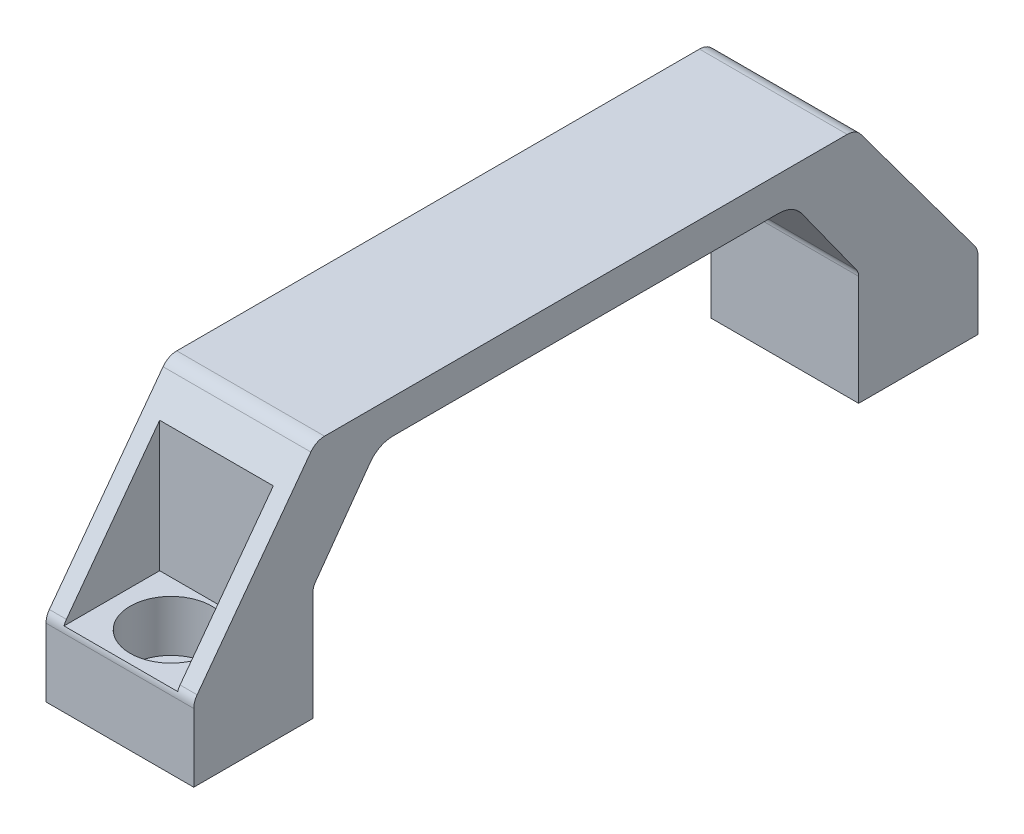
ISO-10303-21;
HEADER;
FILE_DESCRIPTION(('STEP AP214'),'2;1');
FILE_NAME('part.step','',(''),(''),'','','');
FILE_SCHEMA(('AUTOMOTIVE_DESIGN { 1 0 10303 214 1 1 1 1 }'));
ENDSEC;
DATA;
#1=APPLICATION_CONTEXT('core data for automotive mechanical design processes');
#2=APPLICATION_PROTOCOL_DEFINITION('international standard','automotive_design',2000,#1);
#3=PRODUCT_CONTEXT('',#1,'mechanical');
#4=PRODUCT('Part','Part','',(#3));
#5=PRODUCT_RELATED_PRODUCT_CATEGORY('part','',(#4));
#6=PRODUCT_DEFINITION_FORMATION('','',#4);
#7=PRODUCT_DEFINITION_CONTEXT('part definition',#1,'design');
#8=PRODUCT_DEFINITION('design','',#6,#7);
#9=PRODUCT_DEFINITION_SHAPE('','',#8);
#10=(LENGTH_UNIT() NAMED_UNIT(*) SI_UNIT(.MILLI.,.METRE.));
#11=(NAMED_UNIT(*) PLANE_ANGLE_UNIT() SI_UNIT($,.RADIAN.));
#12=(NAMED_UNIT(*) SI_UNIT($,.STERADIAN.) SOLID_ANGLE_UNIT());
#13=UNCERTAINTY_MEASURE_WITH_UNIT(LENGTH_MEASURE(1.E-05),#10,'distance_accuracy_value','');
#14=(GEOMETRIC_REPRESENTATION_CONTEXT(3) GLOBAL_UNCERTAINTY_ASSIGNED_CONTEXT((#13)) GLOBAL_UNIT_ASSIGNED_CONTEXT((#10,
#11,#12)) REPRESENTATION_CONTEXT('',''));
#15=CARTESIAN_POINT('',(0.,0.,0.));
#16=DIRECTION('',(0.,0.,1.));
#17=DIRECTION('',(1.,0.,0.));
#18=AXIS2_PLACEMENT_3D('',#15,#16,#17);
#19=CARTESIAN_POINT('',(0.,4.00000000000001,-55.6));
#20=DIRECTION('',(0.,1.,0.));
#21=DIRECTION('',(0.,0.,1.));
#22=AXIS2_PLACEMENT_3D('',#19,#20,#21);
#23=PLANE('',#22);
#24=CARTESIAN_POINT('',(0.,4.00000000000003,-60.));
#25=DIRECTION('',(0.,-1.,0.));
#26=DIRECTION('',(0.,0.,-1.));
#27=AXIS2_PLACEMENT_3D('',#24,#25,#26);
#28=CIRCLE('',#27,7.19999999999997);
#29=CARTESIAN_POINT('',(0.,4.00000000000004,-67.2));
#30=VERTEX_POINT('',#29);
#31=EDGE_CURVE('E19',#30,#30,#28,.F.);
#32=ORIENTED_EDGE('',*,*,#31,.T.);
#33=EDGE_LOOP('',(#32));
#34=FACE_BOUND('',#33,.T.);
#35=CARTESIAN_POINT('',(0.,4.,-60.));
#36=DIRECTION('',(0.,-1.,0.));
#37=DIRECTION('',(0.,0.,-1.));
#38=AXIS2_PLACEMENT_3D('',#35,#36,#37);
#39=CIRCLE('',#38,4.39999999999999);
#40=CARTESIAN_POINT('',(0.,4.00000000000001,-64.4));
#41=VERTEX_POINT('',#40);
#42=EDGE_CURVE('E590',#41,#41,#39,.T.);
#43=ORIENTED_EDGE('',*,*,#42,.T.);
#44=EDGE_LOOP('',(#43));
#45=FACE_BOUND('',#44,.T.);
#46=ADVANCED_FACE('F16',(#34,#45),#23,.T.);
#47=CARTESIAN_POINT('',(0.,13.,-60.));
#48=DIRECTION('',(0.,-1.,0.));
#49=DIRECTION('',(0.,0.,-1.));
#50=AXIS2_PLACEMENT_3D('',#47,#48,#49);
#51=CYLINDRICAL_SURFACE('',#50,7.19999999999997);
#52=ORIENTED_EDGE('',*,*,#31,.F.);
#53=EDGE_LOOP('',(#52));
#54=FACE_BOUND('',#53,.T.);
#55=CARTESIAN_POINT('',(0.,13.,-60.));
#56=DIRECTION('',(0.,-1.,0.));
#57=DIRECTION('',(0.,0.,-1.));
#58=AXIS2_PLACEMENT_3D('',#55,#56,#57);
#59=CIRCLE('',#58,7.19999999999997);
#60=CARTESIAN_POINT('',(0.,13.,-67.2));
#61=VERTEX_POINT('',#60);
#62=EDGE_CURVE('E358',#61,#61,#59,.T.);
#63=ORIENTED_EDGE('',*,*,#62,.F.);
#64=EDGE_LOOP('',(#63));
#65=FACE_BOUND('',#64,.T.);
#66=ADVANCED_FACE('F603',(#54,#65),#51,.F.);
#67=CARTESIAN_POINT('',(0.,0.,60.));
#68=DIRECTION('',(0.,1.,0.));
#69=DIRECTION('',(0.,0.,1.));
#70=AXIS2_PLACEMENT_3D('',#67,#68,#69);
#71=CYLINDRICAL_SURFACE('',#70,7.19999999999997);
#72=CARTESIAN_POINT('',(0.,4.00000000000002,60.));
#73=DIRECTION('',(0.,1.,0.));
#74=DIRECTION('',(0.,0.,1.));
#75=AXIS2_PLACEMENT_3D('',#72,#73,#74);
#76=CIRCLE('',#75,7.19999999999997);
#77=CARTESIAN_POINT('',(0.,4.00000000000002,67.2));
#78=VERTEX_POINT('',#77);
#79=EDGE_CURVE('E176',#78,#78,#76,.T.);
#80=ORIENTED_EDGE('',*,*,#79,.F.);
#81=EDGE_LOOP('',(#80));
#82=FACE_BOUND('',#81,.T.);
#83=CARTESIAN_POINT('',(0.,13.,60.));
#84=DIRECTION('',(0.,1.,0.));
#85=DIRECTION('',(0.,0.,1.));
#86=AXIS2_PLACEMENT_3D('',#83,#84,#85);
#87=CIRCLE('',#86,7.19999999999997);
#88=CARTESIAN_POINT('',(0.,13.,67.2));
#89=VERTEX_POINT('',#88);
#90=EDGE_CURVE('E338',#89,#89,#87,.F.);
#91=ORIENTED_EDGE('',*,*,#90,.F.);
#92=EDGE_LOOP('',(#91));
#93=FACE_BOUND('',#92,.T.);
#94=ADVANCED_FACE('F606',(#82,#93),#71,.F.);
#95=CARTESIAN_POINT('',(0.,4.,52.8));
#96=DIRECTION('',(0.,1.,0.));
#97=DIRECTION('',(0.,0.,1.));
#98=AXIS2_PLACEMENT_3D('',#95,#96,#97);
#99=PLANE('',#98);
#100=CARTESIAN_POINT('',(0.,4.,60.));
#101=DIRECTION('',(0.,1.,0.));
#102=DIRECTION('',(0.,0.,1.));
#103=AXIS2_PLACEMENT_3D('',#100,#101,#102);
#104=CIRCLE('',#103,4.39999999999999);
#105=CARTESIAN_POINT('',(0.,4.00000000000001,64.4));
#106=VERTEX_POINT('',#105);
#107=EDGE_CURVE('E613',#106,#106,#104,.F.);
#108=ORIENTED_EDGE('',*,*,#107,.T.);
#109=EDGE_LOOP('',(#108));
#110=FACE_BOUND('',#109,.T.);
#111=ORIENTED_EDGE('',*,*,#79,.T.);
#112=EDGE_LOOP('',(#111));
#113=FACE_BOUND('',#112,.T.);
#114=ADVANCED_FACE('F680',(#110,#113),#99,.T.);
#115=CARTESIAN_POINT('',(13.,19.3558155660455,-45.9999999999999));
#116=DIRECTION('',(1.,0.,0.));
#117=DIRECTION('',(0.,0.,-1.));
#118=AXIS2_PLACEMENT_3D('',#115,#116,#117);
#119=CYLINDRICAL_SURFACE('',#118,2.00000000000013);
#120=CARTESIAN_POINT('',(13.,19.3558155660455,-45.9999999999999));
#121=DIRECTION('',(1.,0.,0.));
#122=DIRECTION('',(0.,0.,-1.));
#123=AXIS2_PLACEMENT_3D('',#120,#121,#122);
#124=CIRCLE('',#123,2.00000000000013);
#125=CARTESIAN_POINT('',(13.,20.5230876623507,-47.6240307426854));
#126=VERTEX_POINT('',#125);
#127=CARTESIAN_POINT('',(13.,19.3558155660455,-48.));
#128=VERTEX_POINT('',#127);
#129=EDGE_CURVE('E175',#126,#128,#124,.F.);
#130=ORIENTED_EDGE('',*,*,#129,.F.);
#131=DIRECTION('',(1.,0.,0.));
#132=VECTOR('',#131,1.);
#133=CARTESIAN_POINT('',(13.,20.5230876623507,-47.6240307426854));
#134=LINE('',#133,#132);
#135=CARTESIAN_POINT('',(-13.,20.5230876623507,-47.6240307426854));
#136=VERTEX_POINT('',#135);
#137=EDGE_CURVE('E179',#126,#136,#134,.F.);
#138=ORIENTED_EDGE('',*,*,#137,.T.);
#139=CARTESIAN_POINT('',(-13.,19.3558155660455,-45.9999999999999));
#140=DIRECTION('',(1.,0.,0.));
#141=DIRECTION('',(0.,0.,-1.));
#142=AXIS2_PLACEMENT_3D('',#139,#140,#141);
#143=CIRCLE('',#142,2.00000000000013);
#144=CARTESIAN_POINT('',(-13.,19.3558155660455,-48.));
#145=VERTEX_POINT('',#144);
#146=EDGE_CURVE('E159',#145,#136,#143,.T.);
#147=ORIENTED_EDGE('',*,*,#146,.F.);
#148=DIRECTION('',(-1.,0.,0.));
#149=VECTOR('',#148,1.);
#150=CARTESIAN_POINT('',(13.,19.3558155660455,-48.));
#151=LINE('',#150,#149);
#152=EDGE_CURVE('E184',#145,#128,#151,.F.);
#153=ORIENTED_EDGE('',*,*,#152,.T.);
#154=EDGE_LOOP('',(#130,#138,#147,#153));
#155=FACE_BOUND('',#154,.T.);
#156=ADVANCED_FACE('F180',(#155),#119,.F.);
#157=CARTESIAN_POINT('',(0.,13.,-60.));
#158=DIRECTION('',(0.,-1.,0.));
#159=DIRECTION('',(0.,0.,-1.));
#160=AXIS2_PLACEMENT_3D('',#157,#158,#159);
#161=CYLINDRICAL_SURFACE('',#160,4.39999999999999);
#162=ORIENTED_EDGE('',*,*,#42,.F.);
#163=EDGE_LOOP('',(#162));
#164=FACE_BOUND('',#163,.T.);
#165=CARTESIAN_POINT('',(0.,0.,-60.));
#166=DIRECTION('',(0.,-1.,0.));
#167=DIRECTION('',(0.,0.,-1.));
#168=AXIS2_PLACEMENT_3D('',#165,#166,#167);
#169=CIRCLE('',#168,4.39999999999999);
#170=CARTESIAN_POINT('',(0.,0.,-64.4));
#171=VERTEX_POINT('',#170);
#172=EDGE_CURVE('E250',#171,#171,#169,.T.);
#173=ORIENTED_EDGE('',*,*,#172,.T.);
#174=EDGE_LOOP('',(#173));
#175=FACE_BOUND('',#174,.T.);
#176=ADVANCED_FACE('F674',(#164,#175),#161,.F.);
#177=CARTESIAN_POINT('',(0.,13.,0.));
#178=DIRECTION('',(0.,1.,0.));
#179=DIRECTION('',(0.,0.,1.));
#180=AXIS2_PLACEMENT_3D('',#177,#178,#179);
#181=PLANE('',#180);
#182=ORIENTED_EDGE('',*,*,#62,.T.);
#183=EDGE_LOOP('',(#182));
#184=FACE_BOUND('',#183,.T.);
#185=DIRECTION('',(1.,0.,0.));
#186=VECTOR('',#185,1.);
#187=CARTESIAN_POINT('',(13.,13.,-68.8316717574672));
#188=LINE('',#187,#186);
#189=CARTESIAN_POINT('',(-10.,13.,-68.8316717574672));
#190=VERTEX_POINT('',#189);
#191=CARTESIAN_POINT('',(10.,13.,-68.8316717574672));
#192=VERTEX_POINT('',#191);
#193=EDGE_CURVE('E361',#190,#192,#188,.T.);
#194=ORIENTED_EDGE('',*,*,#193,.F.);
#195=DIRECTION('',(0.,0.,-1.));
#196=VECTOR('',#195,1.);
#197=CARTESIAN_POINT('',(-10.,13.,-142.));
#198=LINE('',#197,#196);
#199=CARTESIAN_POINT('',(-10.,13.,-52.));
#200=VERTEX_POINT('',#199);
#201=EDGE_CURVE('E356',#200,#190,#198,.T.);
#202=ORIENTED_EDGE('',*,*,#201,.F.);
#203=DIRECTION('',(-1.,0.,0.));
#204=VECTOR('',#203,1.);
#205=CARTESIAN_POINT('',(-10.,13.,-52.));
#206=LINE('',#205,#204);
#207=CARTESIAN_POINT('',(10.,13.,-52.));
#208=VERTEX_POINT('',#207);
#209=EDGE_CURVE('E353',#208,#200,#206,.T.);
#210=ORIENTED_EDGE('',*,*,#209,.F.);
#211=DIRECTION('',(0.,0.,1.));
#212=VECTOR('',#211,1.);
#213=CARTESIAN_POINT('',(10.,13.,-52.));
#214=LINE('',#213,#212);
#215=EDGE_CURVE('E335',#192,#208,#214,.T.);
#216=ORIENTED_EDGE('',*,*,#215,.F.);
#217=EDGE_LOOP('',(#194,#202,#210,#216));
#218=FACE_BOUND('',#217,.T.);
#219=ADVANCED_FACE('F670',(#184,#218),#181,.T.);
#220=CARTESIAN_POINT('',(-10.,55.,-142.));
#221=DIRECTION('',(1.,0.,0.));
#222=DIRECTION('',(0.,0.,-1.));
#223=AXIS2_PLACEMENT_3D('',#220,#221,#222);
#224=PLANE('',#223);
#225=CARTESIAN_POINT('',(-10.,12.0092250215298,-66.));
#226=DIRECTION('',(1.,0.,0.));
#227=DIRECTION('',(0.,0.,-1.));
#228=AXIS2_PLACEMENT_3D('',#225,#226,#227);
#229=CIRCLE('',#228,3.00000000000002);
#230=CARTESIAN_POINT('',(-10.,13.7959012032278,-68.4099353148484));
#231=VERTEX_POINT('',#230);
#232=EDGE_CURVE('E249',#231,#190,#229,.F.);
#233=ORIENTED_EDGE('',*,*,#232,.F.);
#234=DIRECTION('',(0.,-0.803311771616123,-0.595558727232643));
#235=VECTOR('',#234,1.);
#236=CARTESIAN_POINT('',(-10.,13.7959012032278,-68.4099353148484));
#237=LINE('',#236,#235);
#238=CARTESIAN_POINT('',(-10.,35.9302325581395,-52.));
#239=VERTEX_POINT('',#238);
#240=EDGE_CURVE('E244',#231,#239,#237,.F.);
#241=ORIENTED_EDGE('',*,*,#240,.T.);
#242=DIRECTION('',(0.,1.,0.));
#243=VECTOR('',#242,1.);
#244=CARTESIAN_POINT('',(-10.,55.,-52.));
#245=LINE('',#244,#243);
#246=EDGE_CURVE('E344',#200,#239,#245,.T.);
#247=ORIENTED_EDGE('',*,*,#246,.F.);
#248=ORIENTED_EDGE('',*,*,#201,.T.);
#249=EDGE_LOOP('',(#233,#241,#247,#248));
#250=FACE_BOUND('',#249,.T.);
#251=ADVANCED_FACE('F666',(#250),#224,.T.);
#252=CARTESIAN_POINT('',(-10.,55.,-52.));
#253=DIRECTION('',(0.,0.,-1.));
#254=DIRECTION('',(-1.,0.,0.));
#255=AXIS2_PLACEMENT_3D('',#252,#253,#254);
#256=PLANE('',#255);
#257=DIRECTION('',(1.,0.,0.));
#258=VECTOR('',#257,1.);
#259=CARTESIAN_POINT('',(13.,35.9302325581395,-52.));
#260=LINE('',#259,#258);
#261=CARTESIAN_POINT('',(10.,35.9302325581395,-52.));
#262=VERTEX_POINT('',#261);
#263=EDGE_CURVE('E328',#239,#262,#260,.T.);
#264=ORIENTED_EDGE('',*,*,#263,.T.);
#265=DIRECTION('',(0.,1.,0.));
#266=VECTOR('',#265,1.);
#267=CARTESIAN_POINT('',(10.,55.,-52.));
#268=LINE('',#267,#266);
#269=EDGE_CURVE('E339',#208,#262,#268,.T.);
#270=ORIENTED_EDGE('',*,*,#269,.F.);
#271=ORIENTED_EDGE('',*,*,#209,.T.);
#272=ORIENTED_EDGE('',*,*,#246,.T.);
#273=EDGE_LOOP('',(#264,#270,#271,#272));
#274=FACE_BOUND('',#273,.T.);
#275=ADVANCED_FACE('F659',(#274),#256,.T.);
#276=CARTESIAN_POINT('',(10.,55.,-52.));
#277=DIRECTION('',(-1.,0.,0.));
#278=DIRECTION('',(0.,0.,1.));
#279=AXIS2_PLACEMENT_3D('',#276,#277,#278);
#280=PLANE('',#279);
#281=CARTESIAN_POINT('',(10.,12.0092250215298,-66.));
#282=DIRECTION('',(1.,0.,0.));
#283=DIRECTION('',(0.,0.,-1.));
#284=AXIS2_PLACEMENT_3D('',#281,#282,#283);
#285=CIRCLE('',#284,3.00000000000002);
#286=CARTESIAN_POINT('',(10.,13.7959012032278,-68.4099353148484));
#287=VERTEX_POINT('',#286);
#288=EDGE_CURVE('E245',#192,#287,#285,.T.);
#289=ORIENTED_EDGE('',*,*,#288,.F.);
#290=ORIENTED_EDGE('',*,*,#215,.T.);
#291=ORIENTED_EDGE('',*,*,#269,.T.);
#292=DIRECTION('',(0.,-0.803311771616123,-0.595558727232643));
#293=VECTOR('',#292,1.);
#294=CARTESIAN_POINT('',(10.,13.7959012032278,-68.4099353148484));
#295=LINE('',#294,#293);
#296=EDGE_CURVE('E241',#262,#287,#295,.T.);
#297=ORIENTED_EDGE('',*,*,#296,.T.);
#298=EDGE_LOOP('',(#289,#290,#291,#297));
#299=FACE_BOUND('',#298,.T.);
#300=ADVANCED_FACE('F650',(#299),#280,.T.);
#301=CARTESIAN_POINT('',(0.,13.,0.));
#302=DIRECTION('',(0.,1.,0.));
#303=DIRECTION('',(0.,0.,1.));
#304=AXIS2_PLACEMENT_3D('',#301,#302,#303);
#305=PLANE('',#304);
#306=ORIENTED_EDGE('',*,*,#90,.T.);
#307=EDGE_LOOP('',(#306));
#308=FACE_BOUND('',#307,.T.);
#309=DIRECTION('',(1.,0.,0.));
#310=VECTOR('',#309,1.);
#311=CARTESIAN_POINT('',(13.,13.,68.8316717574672));
#312=LINE('',#311,#310);
#313=CARTESIAN_POINT('',(10.,13.,68.8316717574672));
#314=VERTEX_POINT('',#313);
#315=CARTESIAN_POINT('',(-10.,13.,68.8316717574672));
#316=VERTEX_POINT('',#315);
#317=EDGE_CURVE('E324',#314,#316,#312,.F.);
#318=ORIENTED_EDGE('',*,*,#317,.F.);
#319=DIRECTION('',(0.,0.,1.));
#320=VECTOR('',#319,1.);
#321=CARTESIAN_POINT('',(10.,13.,142.));
#322=LINE('',#321,#320);
#323=CARTESIAN_POINT('',(10.,13.,52.));
#324=VERTEX_POINT('',#323);
#325=EDGE_CURVE('E292',#324,#314,#322,.T.);
#326=ORIENTED_EDGE('',*,*,#325,.F.);
#327=DIRECTION('',(1.,0.,0.));
#328=VECTOR('',#327,1.);
#329=CARTESIAN_POINT('',(10.,13.,52.));
#330=LINE('',#329,#328);
#331=CARTESIAN_POINT('',(-10.,13.,52.));
#332=VERTEX_POINT('',#331);
#333=EDGE_CURVE('E294',#332,#324,#330,.T.);
#334=ORIENTED_EDGE('',*,*,#333,.F.);
#335=DIRECTION('',(0.,0.,-1.));
#336=VECTOR('',#335,1.);
#337=CARTESIAN_POINT('',(-10.,13.,52.));
#338=LINE('',#337,#336);
#339=EDGE_CURVE('E295',#316,#332,#338,.T.);
#340=ORIENTED_EDGE('',*,*,#339,.F.);
#341=EDGE_LOOP('',(#318,#326,#334,#340));
#342=FACE_BOUND('',#341,.T.);
#343=ADVANCED_FACE('F647',(#308,#342),#305,.T.);
#344=CARTESIAN_POINT('',(0.,0.,60.));
#345=DIRECTION('',(0.,1.,0.));
#346=DIRECTION('',(0.,0.,1.));
#347=AXIS2_PLACEMENT_3D('',#344,#345,#346);
#348=CYLINDRICAL_SURFACE('',#347,4.39999999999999);
#349=ORIENTED_EDGE('',*,*,#107,.F.);
#350=EDGE_LOOP('',(#349));
#351=FACE_BOUND('',#350,.T.);
#352=CARTESIAN_POINT('',(0.,0.,60.));
#353=DIRECTION('',(0.,1.,0.));
#354=DIRECTION('',(0.,0.,1.));
#355=AXIS2_PLACEMENT_3D('',#352,#353,#354);
#356=CIRCLE('',#355,4.39999999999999);
#357=CARTESIAN_POINT('',(0.,0.,64.4));
#358=VERTEX_POINT('',#357);
#359=EDGE_CURVE('E209',#358,#358,#356,.F.);
#360=ORIENTED_EDGE('',*,*,#359,.T.);
#361=EDGE_LOOP('',(#360));
#362=FACE_BOUND('',#361,.T.);
#363=ADVANCED_FACE('F649',(#351,#362),#348,.F.);
#364=CARTESIAN_POINT('',(13.,19.3558155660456,46.));
#365=DIRECTION('',(1.,0.,0.));
#366=DIRECTION('',(0.,0.,-1.));
#367=AXIS2_PLACEMENT_3D('',#364,#365,#366);
#368=CYLINDRICAL_SURFACE('',#367,2.);
#369=CARTESIAN_POINT('',(13.,19.3558155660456,46.));
#370=DIRECTION('',(1.,0.,0.));
#371=DIRECTION('',(0.,0.,-1.));
#372=AXIS2_PLACEMENT_3D('',#369,#370,#371);
#373=CIRCLE('',#372,2.);
#374=CARTESIAN_POINT('',(13.,19.3558155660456,48.));
#375=VERTEX_POINT('',#374);
#376=CARTESIAN_POINT('',(13.,20.5230876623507,47.6240307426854));
#377=VERTEX_POINT('',#376);
#378=EDGE_CURVE('E317',#375,#377,#373,.F.);
#379=ORIENTED_EDGE('',*,*,#378,.F.);
#380=DIRECTION('',(1.,0.,0.));
#381=VECTOR('',#380,1.);
#382=CARTESIAN_POINT('',(13.,19.3558155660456,48.));
#383=LINE('',#382,#381);
#384=CARTESIAN_POINT('',(-13.,19.3558155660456,48.));
#385=VERTEX_POINT('',#384);
#386=EDGE_CURVE('E202',#375,#385,#383,.F.);
#387=ORIENTED_EDGE('',*,*,#386,.T.);
#388=CARTESIAN_POINT('',(-13.,19.3558155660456,46.));
#389=DIRECTION('',(1.,0.,0.));
#390=DIRECTION('',(0.,0.,-1.));
#391=AXIS2_PLACEMENT_3D('',#388,#389,#390);
#392=CIRCLE('',#391,2.);
#393=CARTESIAN_POINT('',(-13.,20.5230876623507,47.6240307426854));
#394=VERTEX_POINT('',#393);
#395=EDGE_CURVE('E616',#394,#385,#392,.T.);
#396=ORIENTED_EDGE('',*,*,#395,.F.);
#397=DIRECTION('',(1.,0.,0.));
#398=VECTOR('',#397,1.);
#399=CARTESIAN_POINT('',(13.,20.5230876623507,47.6240307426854));
#400=LINE('',#399,#398);
#401=EDGE_CURVE('E272',#394,#377,#400,.T.);
#402=ORIENTED_EDGE('',*,*,#401,.T.);
#403=EDGE_LOOP('',(#379,#387,#396,#402));
#404=FACE_BOUND('',#403,.T.);
#405=ADVANCED_FACE('F622',(#404),#368,.F.);
#406=CARTESIAN_POINT('',(-10.,55.,52.));
#407=DIRECTION('',(1.,0.,0.));
#408=DIRECTION('',(0.,0.,-1.));
#409=AXIS2_PLACEMENT_3D('',#406,#407,#408);
#410=PLANE('',#409);
#411=CARTESIAN_POINT('',(-10.,12.0092250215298,65.9999999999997));
#412=DIRECTION('',(1.,0.,0.));
#413=DIRECTION('',(0.,0.,-1.));
#414=AXIS2_PLACEMENT_3D('',#411,#412,#413);
#415=CIRCLE('',#414,3.00000000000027);
#416=CARTESIAN_POINT('',(-10.,13.7959012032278,68.4099353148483));
#417=VERTEX_POINT('',#416);
#418=EDGE_CURVE('E227',#316,#417,#415,.F.);
#419=ORIENTED_EDGE('',*,*,#418,.F.);
#420=ORIENTED_EDGE('',*,*,#339,.T.);
#421=DIRECTION('',(0.,1.,0.));
#422=VECTOR('',#421,1.);
#423=CARTESIAN_POINT('',(-10.,55.,52.));
#424=LINE('',#423,#422);
#425=CARTESIAN_POINT('',(-10.,35.9302325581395,52.));
#426=VERTEX_POINT('',#425);
#427=EDGE_CURVE('E275',#426,#332,#424,.F.);
#428=ORIENTED_EDGE('',*,*,#427,.F.);
#429=DIRECTION('',(0.,0.803311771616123,-0.595558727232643));
#430=VECTOR('',#429,1.);
#431=CARTESIAN_POINT('',(-10.,40.7866761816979,48.3995331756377));
#432=LINE('',#431,#430);
#433=EDGE_CURVE('E205',#426,#417,#432,.F.);
#434=ORIENTED_EDGE('',*,*,#433,.T.);
#435=EDGE_LOOP('',(#419,#420,#428,#434));
#436=FACE_BOUND('',#435,.T.);
#437=ADVANCED_FACE('F636',(#436),#410,.T.);
#438=CARTESIAN_POINT('',(10.,55.,142.));
#439=DIRECTION('',(-1.,0.,0.));
#440=DIRECTION('',(0.,0.,1.));
#441=AXIS2_PLACEMENT_3D('',#438,#439,#440);
#442=PLANE('',#441);
#443=CARTESIAN_POINT('',(10.,12.0092250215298,65.9999999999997));
#444=DIRECTION('',(1.,0.,0.));
#445=DIRECTION('',(0.,0.,-1.));
#446=AXIS2_PLACEMENT_3D('',#443,#444,#445);
#447=CIRCLE('',#446,3.00000000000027);
#448=CARTESIAN_POINT('',(10.,13.7959012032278,68.4099353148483));
#449=VERTEX_POINT('',#448);
#450=EDGE_CURVE('E286',#449,#314,#447,.T.);
#451=ORIENTED_EDGE('',*,*,#450,.F.);
#452=DIRECTION('',(0.,0.803311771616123,-0.595558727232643));
#453=VECTOR('',#452,1.);
#454=CARTESIAN_POINT('',(10.,40.7866761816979,48.3995331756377));
#455=LINE('',#454,#453);
#456=CARTESIAN_POINT('',(10.,35.9302325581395,52.));
#457=VERTEX_POINT('',#456);
#458=EDGE_CURVE('E231',#449,#457,#455,.T.);
#459=ORIENTED_EDGE('',*,*,#458,.T.);
#460=DIRECTION('',(0.,1.,0.));
#461=VECTOR('',#460,1.);
#462=CARTESIAN_POINT('',(10.,55.,52.));
#463=LINE('',#462,#461);
#464=EDGE_CURVE('E306',#324,#457,#463,.T.);
#465=ORIENTED_EDGE('',*,*,#464,.F.);
#466=ORIENTED_EDGE('',*,*,#325,.T.);
#467=EDGE_LOOP('',(#451,#459,#465,#466));
#468=FACE_BOUND('',#467,.T.);
#469=ADVANCED_FACE('F643',(#468),#442,.T.);
#470=CARTESIAN_POINT('',(10.,55.,52.));
#471=DIRECTION('',(0.,0.,1.));
#472=DIRECTION('',(1.,0.,0.));
#473=AXIS2_PLACEMENT_3D('',#470,#471,#472);
#474=PLANE('',#473);
#475=DIRECTION('',(1.,0.,0.));
#476=VECTOR('',#475,1.);
#477=CARTESIAN_POINT('',(13.,35.9302325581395,52.));
#478=LINE('',#477,#476);
#479=EDGE_CURVE('E193',#457,#426,#478,.F.);
#480=ORIENTED_EDGE('',*,*,#479,.T.);
#481=ORIENTED_EDGE('',*,*,#427,.T.);
#482=ORIENTED_EDGE('',*,*,#333,.T.);
#483=ORIENTED_EDGE('',*,*,#464,.T.);
#484=EDGE_LOOP('',(#480,#481,#482,#483));
#485=FACE_BOUND('',#484,.T.);
#486=ADVANCED_FACE('F640',(#485),#474,.T.);
#487=CARTESIAN_POINT('',(13.,20.5230876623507,47.6240307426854));
#488=DIRECTION('',(0.,0.583636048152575,0.812015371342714));
#489=DIRECTION('',(0.,-0.812015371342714,0.583636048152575));
#490=AXIS2_PLACEMENT_3D('',#487,#488,#489);
#491=PLANE('',#490);
#492=DIRECTION('',(0.,0.812015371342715,-0.583636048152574));
#493=VECTOR('',#492,1.);
#494=CARTESIAN_POINT('',(13.,20.5230876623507,47.6240307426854));
#495=LINE('',#494,#493);
#496=CARTESIAN_POINT('',(13.,33.9181802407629,37.9963079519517));
#497=VERTEX_POINT('',#496);
#498=EDGE_CURVE('E388',#377,#497,#495,.T.);
#499=ORIENTED_EDGE('',*,*,#498,.F.);
#500=ORIENTED_EDGE('',*,*,#401,.F.);
#501=DIRECTION('',(0.,0.812015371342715,-0.583636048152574));
#502=VECTOR('',#501,1.);
#503=CARTESIAN_POINT('',(-13.,20.5230876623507,47.6240307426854));
#504=LINE('',#503,#502);
#505=CARTESIAN_POINT('',(-13.,33.9181802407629,37.9963079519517));
#506=VERTEX_POINT('',#505);
#507=EDGE_CURVE('E393',#394,#506,#504,.T.);
#508=ORIENTED_EDGE('',*,*,#507,.T.);
#509=DIRECTION('',(1.,0.,0.));
#510=VECTOR('',#509,1.);
#511=CARTESIAN_POINT('',(13.,33.9181802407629,37.9963079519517));
#512=LINE('',#511,#510);
#513=EDGE_CURVE('E268',#506,#497,#512,.T.);
#514=ORIENTED_EDGE('',*,*,#513,.T.);
#515=EDGE_LOOP('',(#499,#500,#508,#514));
#516=FACE_BOUND('',#515,.T.);
#517=ADVANCED_FACE('F768',(#516),#491,.F.);
#518=CARTESIAN_POINT('',(13.,31.,33.9362310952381));
#519=DIRECTION('',(1.,0.,0.));
#520=DIRECTION('',(0.,0.,-1.));
#521=AXIS2_PLACEMENT_3D('',#518,#519,#520);
#522=CYLINDRICAL_SURFACE('',#521,4.99999999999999);
#523=CARTESIAN_POINT('',(13.,31.,33.9362310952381));
#524=DIRECTION('',(1.,0.,0.));
#525=DIRECTION('',(0.,0.,-1.));
#526=AXIS2_PLACEMENT_3D('',#523,#524,#525);
#527=CIRCLE('',#526,4.99999999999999);
#528=CARTESIAN_POINT('',(13.,36.,33.9362310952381));
#529=VERTEX_POINT('',#528);
#530=EDGE_CURVE('E386',#497,#529,#527,.F.);
#531=ORIENTED_EDGE('',*,*,#530,.F.);
#532=ORIENTED_EDGE('',*,*,#513,.F.);
#533=CARTESIAN_POINT('',(-13.,31.,33.9362310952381));
#534=DIRECTION('',(1.,0.,0.));
#535=DIRECTION('',(0.,0.,-1.));
#536=AXIS2_PLACEMENT_3D('',#533,#534,#535);
#537=CIRCLE('',#536,4.99999999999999);
#538=CARTESIAN_POINT('',(-13.,36.,33.9362310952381));
#539=VERTEX_POINT('',#538);
#540=EDGE_CURVE('E390',#506,#539,#537,.F.);
#541=ORIENTED_EDGE('',*,*,#540,.T.);
#542=CARTESIAN_POINT('',(13.,36.,33.9362310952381));
#543=CARTESIAN_POINT('',(13.0000157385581,36.0000056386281,33.9847392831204));
#544=CARTESIAN_POINT('',(12.997758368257,35.9992934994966,34.0332170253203));
#545=CARTESIAN_POINT('',(12.9888536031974,35.9964884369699,34.1296647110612));
#546=CARTESIAN_POINT('',(12.9822120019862,35.9943973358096,34.1776352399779));
#547=CARTESIAN_POINT('',(12.9561728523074,35.9862093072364,34.3190199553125));
#548=CARTESIAN_POINT('',(12.9306515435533,35.9781944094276,34.4112414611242));
#549=CARTESIAN_POINT('',(12.8586713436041,35.9557056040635,34.609272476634));
#550=CARTESIAN_POINT('',(12.8088831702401,35.9402112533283,34.7137209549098));
#551=CARTESIAN_POINT('',(12.6937031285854,35.9046734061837,34.913234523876));
#552=CARTESIAN_POINT('',(12.6282305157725,35.8846063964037,35.0082473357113));
#553=CARTESIAN_POINT('',(12.4995359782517,35.8455588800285,35.1716352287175));
#554=CARTESIAN_POINT('',(12.4382058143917,35.8270835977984,35.2416597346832));
#555=CARTESIAN_POINT('',(12.309848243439,35.7887573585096,35.3759076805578));
#556=CARTESIAN_POINT('',(12.2428169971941,35.768905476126,35.4401271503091));
#557=CARTESIAN_POINT('',(12.0350399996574,35.7079607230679,35.625032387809));
#558=CARTESIAN_POINT('',(11.8877042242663,35.6655072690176,35.7378538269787));
#559=CARTESIAN_POINT('',(11.5763372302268,35.577728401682,35.9507071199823));
#560=CARTESIAN_POINT('',(11.4118803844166,35.5323554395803,36.0500743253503));
#561=CARTESIAN_POINT('',(11.0749923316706,35.4416572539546,36.2345410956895));
#562=CARTESIAN_POINT('',(10.902552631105,35.3963321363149,36.3196249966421));
#563=CARTESIAN_POINT('',(10.5518710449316,35.3065455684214,36.4782731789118));
#564=CARTESIAN_POINT('',(10.3736182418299,35.2620860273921,36.5518140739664));
#565=CARTESIAN_POINT('',(10.0131826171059,35.1746737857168,36.6891752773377));
#566=CARTESIAN_POINT('',(9.83100160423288,35.1317204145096,36.7529999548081));
#567=CARTESIAN_POINT('',(9.3651601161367,35.0251262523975,36.9045661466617));
#568=CARTESIAN_POINT('',(9.07942636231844,34.9627318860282,36.9868000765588));
#569=CARTESIAN_POINT('',(8.50294866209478,34.8430529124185,37.1362399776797));
#570=CARTESIAN_POINT('',(8.21220245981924,34.7857706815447,37.203438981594));
#571=CARTESIAN_POINT('',(7.62666575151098,34.6767066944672,37.3257064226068));
#572=CARTESIAN_POINT('',(7.33186942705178,34.6249340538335,37.380754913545));
#573=CARTESIAN_POINT('',(6.73958359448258,34.5272820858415,37.4806846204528));
#574=CARTESIAN_POINT('',(6.44209383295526,34.4814033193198,37.5255648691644));
#575=CARTESIAN_POINT('',(5.84314954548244,34.3954526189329,37.6069835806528));
#576=CARTESIAN_POINT('',(5.54168181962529,34.3554202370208,37.6434661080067));
#577=CARTESIAN_POINT('',(4.93716715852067,34.2816440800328,37.7089277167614));
#578=CARTESIAN_POINT('',(4.63412018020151,34.2479004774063,37.7379065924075));
#579=CARTESIAN_POINT('',(4.02713296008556,34.1868179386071,37.7892534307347));
#580=CARTESIAN_POINT('',(3.7231939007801,34.1594726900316,37.8116279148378));
#581=CARTESIAN_POINT('',(3.1144299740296,34.1111999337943,37.8504854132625));
#582=CARTESIAN_POINT('',(2.80960508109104,34.0902726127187,37.8669682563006));
#583=CARTESIAN_POINT('',(2.03940457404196,34.0455986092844,37.9017745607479));
#584=CARTESIAN_POINT('',(1.57361112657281,34.0261223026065,37.9165354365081));
#585=CARTESIAN_POINT('',(0.641388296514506,34.0022420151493,37.9345747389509));
#586=CARTESIAN_POINT('',(0.174958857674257,33.9978394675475,37.9378520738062));
#587=CARTESIAN_POINT('',(-0.7584705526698,34.0041286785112,37.933133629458));
#588=CARTESIAN_POINT('',(-1.22547028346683,34.0148439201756,37.9251203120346));
#589=CARTESIAN_POINT('',(-2.15849703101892,34.0513735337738,37.8972479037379));
#590=CARTESIAN_POINT('',(-2.62452412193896,34.0771867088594,37.8773897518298));
#591=CARTESIAN_POINT('',(-3.5505646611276,34.1435093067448,37.8246919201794));
#592=CARTESIAN_POINT('',(-4.01059443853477,34.1838840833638,37.7919709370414));
#593=CARTESIAN_POINT('',(-4.92797340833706,34.2791935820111,37.7112597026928));
#594=CARTESIAN_POINT('',(-5.38532191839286,34.3341318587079,37.6632657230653));
#595=CARTESIAN_POINT('',(-6.06756426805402,34.4271120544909,37.5771983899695));
#596=CARTESIAN_POINT('',(-6.29409695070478,34.4598250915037,37.5462057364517));
#597=CARTESIAN_POINT('',(-6.7458369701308,34.52871296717,37.4789018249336));
#598=CARTESIAN_POINT('',(-6.97104439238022,34.5648875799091,37.4425909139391));
#599=CARTESIAN_POINT('',(-7.41971575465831,34.6405872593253,37.363927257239));
#600=CARTESIAN_POINT('',(-7.64318054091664,34.6801105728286,37.3215776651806));
#601=CARTESIAN_POINT('',(-8.08805812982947,34.7623904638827,37.2298948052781));
#602=CARTESIAN_POINT('',(-8.30947121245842,34.8051465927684,37.180562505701));
#603=CARTESIAN_POINT('',(-8.67086528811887,34.8778467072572,37.0928559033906));
#604=CARTESIAN_POINT('',(-8.8116114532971,34.9068952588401,37.0568845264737));
#605=CARTESIAN_POINT('',(-9.09184744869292,34.9661813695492,36.9811809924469));
#606=CARTESIAN_POINT('',(-9.23133723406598,34.9964189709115,36.9414487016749));
#607=CARTESIAN_POINT('',(-9.50917002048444,35.0580755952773,36.8576581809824));
#608=CARTESIAN_POINT('',(-9.64750906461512,35.089497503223,36.8135889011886));
#609=CARTESIAN_POINT('',(-9.92233806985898,35.1533302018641,36.7206567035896));
#610=CARTESIAN_POINT('',(-10.058828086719,35.18574096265,36.6717939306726));
#611=CARTESIAN_POINT('',(-10.3507299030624,35.2565383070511,36.5605204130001));
#612=CARTESIAN_POINT('',(-10.5057588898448,35.2950660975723,36.4971862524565));
#613=CARTESIAN_POINT('',(-10.8118089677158,35.3728916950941,36.3619088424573));
#614=CARTESIAN_POINT('',(-10.9628309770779,35.4121893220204,36.2899675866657));
#615=CARTESIAN_POINT('',(-11.25895471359,35.4909073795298,36.1360502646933));
#616=CARTESIAN_POINT('',(-11.4040760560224,35.530326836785,36.0541118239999));
#617=CARTESIAN_POINT('',(-11.6866849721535,35.6086105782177,35.8778851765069));
#618=CARTESIAN_POINT('',(-11.8241813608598,35.6474754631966,35.7836116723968));
#619=CARTESIAN_POINT('',(-12.0582925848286,35.7148171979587,35.6028351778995));
#620=CARTESIAN_POINT('',(-12.1571321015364,35.7436594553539,35.5193776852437));
#621=CARTESIAN_POINT('',(-12.3456717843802,35.7993480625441,35.3415636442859));
#622=CARTESIAN_POINT('',(-12.435353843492,35.8261904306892,35.2471862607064));
#623=CARTESIAN_POINT('',(-12.6024720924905,35.876724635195,35.04466470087));
#624=CARTESIAN_POINT('',(-12.6797073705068,35.9003639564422,34.9363374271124));
#625=CARTESIAN_POINT('',(-12.8133940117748,35.9415948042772,34.7069578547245));
#626=CARTESIAN_POINT('',(-12.8699816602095,35.9592259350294,34.5859960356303));
#627=CARTESIAN_POINT('',(-12.9405569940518,35.9813027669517,34.3763020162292));
#628=CARTESIAN_POINT('',(-12.9624818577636,35.9881918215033,34.2905321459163));
#629=CARTESIAN_POINT('',(-12.9847995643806,35.9952119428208,34.1594157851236));
#630=CARTESIAN_POINT('',(-12.9904787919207,35.9970002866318,34.115023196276));
#631=CARTESIAN_POINT('',(-12.998087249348,35.9993971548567,34.0258383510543));
#632=CARTESIAN_POINT('',(-13.000012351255,36.0000043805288,33.9810457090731));
#633=CARTESIAN_POINT('',(-13.,36.,33.9362310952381));
#634=B_SPLINE_CURVE_WITH_KNOTS('',3,(#542,#543,#544,#545,#546,#547,#548,#549,#550,#551,#552,
#553,#554,#555,#556,#557,#558,#559,#560,#561,#562,#563,#564,#565,#566,#567,#568,#569,#570,#571,
#572,#573,#574,#575,#576,#577,#578,#579,#580,#581,#582,#583,#584,#585,#586,#587,#588,#589,#590,
#591,#592,#593,#594,#595,#596,#597,#598,#599,#600,#601,#602,#603,#604,#605,#606,#607,#608,#609,
#610,#611,#612,#613,#614,#615,#616,#617,#618,#619,#620,#621,#622,#623,#624,#625,#626,#627,#628,
#629,#630,#631,#632,#633),.UNSPECIFIED.,.F.,.F.,(4,2,2,2,2,2,2,2,2,2,2,2,2,2,2,2,2,2,2,2,2,2,2,
2,2,2,2,2,2,2,2,2,2,2,2,2,2,2,2,2,2,2,2,2,2,4),(0.,0.145411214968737,0.29063065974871,
0.577131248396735,0.925443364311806,1.27558867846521,1.55989374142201,1.84439179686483,
2.41382669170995,3.00531776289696,3.59745332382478,4.19077348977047,4.78382606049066,
5.69462729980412,6.60584974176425,7.51855709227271,8.43135122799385,9.35005987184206,
10.2687937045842,11.1866172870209,12.1044675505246,13.5033472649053,14.9023599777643,
16.3035482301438,17.7046254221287,19.0930662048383,20.4818461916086,21.1746874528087,
21.8674835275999,22.5599191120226,23.2522587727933,23.696648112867,24.1410532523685,
24.5866215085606,25.0321763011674,25.5474814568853,26.0626674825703,26.5759711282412,
27.0886684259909,27.4856946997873,27.8834914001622,28.2871762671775,28.6881462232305,
28.9532911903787,29.0875017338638,29.2218597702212),.UNSPECIFIED.);
#635=EDGE_CURVE('E271',#529,#539,#634,.T.);
#636=ORIENTED_EDGE('',*,*,#635,.F.);
#637=EDGE_LOOP('',(#531,#532,#541,#636));
#638=FACE_BOUND('',#637,.T.);
#639=ADVANCED_FACE('F777',(#638),#522,.F.);
#640=CARTESIAN_POINT('',(0.,77.25,38.5));
#641=DIRECTION('',(0.,0.,1.));
#642=DIRECTION('',(1.,0.,0.));
#643=AXIS2_PLACEMENT_3D('',#640,#641,#642);
#644=CYLINDRICAL_SURFACE('',#643,43.25);
#645=ORIENTED_EDGE('',*,*,#635,.T.);
#646=DIRECTION('',(0.,0.,-1.));
#647=VECTOR('',#646,1.);
#648=CARTESIAN_POINT('',(-13.,36.,65.9999999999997));
#649=LINE('',#648,#647);
#650=CARTESIAN_POINT('',(-13.0000000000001,36.,-33.9362310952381));
#651=VERTEX_POINT('',#650);
#652=EDGE_CURVE('E236',#539,#651,#649,.T.);
#653=ORIENTED_EDGE('',*,*,#652,.T.);
#654=CARTESIAN_POINT('',(-13.0000000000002,36.,-33.9362310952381));
#655=CARTESIAN_POINT('',(-13.0000157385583,36.0000056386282,-33.9847392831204));
#656=CARTESIAN_POINT('',(-12.9977583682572,35.9992934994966,-34.0332170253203));
#657=CARTESIAN_POINT('',(-12.9888536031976,35.99648843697,-34.1296647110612));
#658=CARTESIAN_POINT('',(-12.9822120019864,35.9943973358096,-34.1776352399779));
#659=CARTESIAN_POINT('',(-12.9561728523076,35.9862093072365,-34.3190199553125));
#660=CARTESIAN_POINT('',(-12.9306515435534,35.9781944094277,-34.4112414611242));
#661=CARTESIAN_POINT('',(-12.8586713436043,35.9557056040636,-34.609272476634));
#662=CARTESIAN_POINT('',(-12.8088831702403,35.9402112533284,-34.7137209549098));
#663=CARTESIAN_POINT('',(-12.6937031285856,35.9046734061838,-34.913234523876));
#664=CARTESIAN_POINT('',(-12.6282305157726,35.8846063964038,-35.0082473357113));
#665=CARTESIAN_POINT('',(-12.4995359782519,35.8455588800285,-35.1716352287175));
#666=CARTESIAN_POINT('',(-12.4382058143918,35.8270835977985,-35.2416597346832));
#667=CARTESIAN_POINT('',(-12.3098482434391,35.7887573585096,-35.3759076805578));
#668=CARTESIAN_POINT('',(-12.2428169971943,35.768905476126,-35.4401271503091));
#669=CARTESIAN_POINT('',(-12.0350399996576,35.707960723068,-35.6250323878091));
#670=CARTESIAN_POINT('',(-11.8877042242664,35.6655072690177,-35.7378538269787));
#671=CARTESIAN_POINT('',(-11.5763372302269,35.577728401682,-35.9507071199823));
#672=CARTESIAN_POINT('',(-11.4118803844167,35.5323554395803,-36.0500743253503));
#673=CARTESIAN_POINT('',(-11.0749923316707,35.4416572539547,-36.2345410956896));
#674=CARTESIAN_POINT('',(-10.9025526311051,35.396332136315,-36.3196249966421));
#675=CARTESIAN_POINT('',(-10.5518710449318,35.3065455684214,-36.4782731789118));
#676=CARTESIAN_POINT('',(-10.37361824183,35.2620860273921,-36.5518140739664));
#677=CARTESIAN_POINT('',(-10.0131826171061,35.1746737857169,-36.6891752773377));
#678=CARTESIAN_POINT('',(-9.831001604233,35.1317204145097,-36.7529999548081));
#679=CARTESIAN_POINT('',(-9.36516011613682,35.0251262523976,-36.9045661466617));
#680=CARTESIAN_POINT('',(-9.07942636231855,34.9627318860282,-36.9868000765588));
#681=CARTESIAN_POINT('',(-8.5029486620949,34.8430529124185,-37.1362399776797));
#682=CARTESIAN_POINT('',(-8.21220245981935,34.7857706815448,-37.2034389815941));
#683=CARTESIAN_POINT('',(-7.62666575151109,34.6767066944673,-37.3257064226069));
#684=CARTESIAN_POINT('',(-7.33186942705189,34.6249340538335,-37.3807549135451));
#685=CARTESIAN_POINT('',(-6.73958359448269,34.5272820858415,-37.4806846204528));
#686=CARTESIAN_POINT('',(-6.44209383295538,34.4814033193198,-37.5255648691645));
#687=CARTESIAN_POINT('',(-5.84314954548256,34.395452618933,-37.6069835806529));
#688=CARTESIAN_POINT('',(-5.5416818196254,34.3554202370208,-37.6434661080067));
#689=CARTESIAN_POINT('',(-4.93716715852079,34.2816440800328,-37.7089277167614));
#690=CARTESIAN_POINT('',(-4.63412018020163,34.2479004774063,-37.7379065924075));
#691=CARTESIAN_POINT('',(-4.02713296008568,34.1868179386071,-37.7892534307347));
#692=CARTESIAN_POINT('',(-3.72319390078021,34.1594726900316,-37.8116279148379));
#693=CARTESIAN_POINT('',(-3.11442997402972,34.1111999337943,-37.8504854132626));
#694=CARTESIAN_POINT('',(-2.80960508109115,34.0902726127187,-37.8669682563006));
#695=CARTESIAN_POINT('',(-2.03940457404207,34.0455986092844,-37.901774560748));
#696=CARTESIAN_POINT('',(-1.57361112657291,34.0261223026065,-37.9165354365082));
#697=CARTESIAN_POINT('',(-0.6413882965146,34.0022420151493,-37.9345747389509));
#698=CARTESIAN_POINT('',(-0.174958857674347,33.9978394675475,-37.9378520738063));
#699=CARTESIAN_POINT('',(0.758470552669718,34.0041286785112,-37.9331336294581));
#700=CARTESIAN_POINT('',(1.22547028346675,34.0148439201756,-37.9251203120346));
#701=CARTESIAN_POINT('',(2.15849703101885,34.0513735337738,-37.897247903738));
#702=CARTESIAN_POINT('',(2.62452412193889,34.0771867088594,-37.8773897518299));
#703=CARTESIAN_POINT('',(3.55056466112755,34.1435093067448,-37.8246919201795));
#704=CARTESIAN_POINT('',(4.01059443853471,34.1838840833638,-37.7919709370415));
#705=CARTESIAN_POINT('',(4.92797340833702,34.2791935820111,-37.7112597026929));
#706=CARTESIAN_POINT('',(5.38532191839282,34.3341318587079,-37.6632657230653));
#707=CARTESIAN_POINT('',(6.06756426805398,34.4271120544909,-37.5771983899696));
#708=CARTESIAN_POINT('',(6.29409695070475,34.4598250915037,-37.5462057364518));
#709=CARTESIAN_POINT('',(6.74583697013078,34.52871296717,-37.4789018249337));
#710=CARTESIAN_POINT('',(6.9710443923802,34.5648875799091,-37.4425909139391));
#711=CARTESIAN_POINT('',(7.41971575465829,34.6405872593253,-37.3639272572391));
#712=CARTESIAN_POINT('',(7.64318054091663,34.6801105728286,-37.3215776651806));
#713=CARTESIAN_POINT('',(8.08805812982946,34.7623904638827,-37.2298948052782));
#714=CARTESIAN_POINT('',(8.30947121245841,34.8051465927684,-37.1805625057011));
#715=CARTESIAN_POINT('',(8.67086528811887,34.8778467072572,-37.0928559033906));
#716=CARTESIAN_POINT('',(8.81161145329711,34.9068952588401,-37.0568845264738));
#717=CARTESIAN_POINT('',(9.09184744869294,34.9661813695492,-36.9811809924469));
#718=CARTESIAN_POINT('',(9.23133723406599,34.9964189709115,-36.9414487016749));
#719=CARTESIAN_POINT('',(9.50917002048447,35.0580755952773,-36.8576581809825));
#720=CARTESIAN_POINT('',(9.64750906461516,35.089497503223,-36.8135889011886));
#721=CARTESIAN_POINT('',(9.92233806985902,35.1533302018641,-36.7206567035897));
#722=CARTESIAN_POINT('',(10.058828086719,35.18574096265,-36.6717939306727));
#723=CARTESIAN_POINT('',(10.3507299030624,35.2565383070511,-36.5605204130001));
#724=CARTESIAN_POINT('',(10.5057588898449,35.2950660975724,-36.4971862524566));
#725=CARTESIAN_POINT('',(10.8118089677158,35.3728916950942,-36.3619088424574));
#726=CARTESIAN_POINT('',(10.962830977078,35.4121893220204,-36.2899675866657));
#727=CARTESIAN_POINT('',(11.2589547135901,35.4909073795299,-36.1360502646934));
#728=CARTESIAN_POINT('',(11.4040760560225,35.530326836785,-36.0541118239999));
#729=CARTESIAN_POINT('',(11.6866849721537,35.6086105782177,-35.877885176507));
#730=CARTESIAN_POINT('',(11.82418136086,35.6474754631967,-35.7836116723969));
#731=CARTESIAN_POINT('',(12.0582925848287,35.7148171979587,-35.6028351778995));
#732=CARTESIAN_POINT('',(12.1571321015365,35.7436594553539,-35.5193776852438));
#733=CARTESIAN_POINT('',(12.3456717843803,35.7993480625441,-35.341563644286));
#734=CARTESIAN_POINT('',(12.4353538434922,35.8261904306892,-35.2471862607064));
#735=CARTESIAN_POINT('',(12.6024720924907,35.876724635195,-35.04466470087));
#736=CARTESIAN_POINT('',(12.6797073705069,35.9003639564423,-34.9363374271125));
#737=CARTESIAN_POINT('',(12.813394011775,35.9415948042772,-34.7069578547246));
#738=CARTESIAN_POINT('',(12.8699816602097,35.9592259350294,-34.5859960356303));
#739=CARTESIAN_POINT('',(12.9405569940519,35.9813027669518,-34.3763020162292));
#740=CARTESIAN_POINT('',(12.9624818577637,35.9881918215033,-34.2905321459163));
#741=CARTESIAN_POINT('',(12.9847995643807,35.9952119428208,-34.1594157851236));
#742=CARTESIAN_POINT('',(12.9904787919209,35.9970002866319,-34.115023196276));
#743=CARTESIAN_POINT('',(12.9980872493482,35.9993971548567,-34.0258383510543));
#744=CARTESIAN_POINT('',(13.0000123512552,36.0000043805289,-33.9810457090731));
#745=CARTESIAN_POINT('',(13.0000000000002,36.,-33.9362310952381));
#746=B_SPLINE_CURVE_WITH_KNOTS('',3,(#654,#655,#656,#657,#658,#659,#660,#661,#662,#663,#664,
#665,#666,#667,#668,#669,#670,#671,#672,#673,#674,#675,#676,#677,#678,#679,#680,#681,#682,#683,
#684,#685,#686,#687,#688,#689,#690,#691,#692,#693,#694,#695,#696,#697,#698,#699,#700,#701,#702,
#703,#704,#705,#706,#707,#708,#709,#710,#711,#712,#713,#714,#715,#716,#717,#718,#719,#720,#721,
#722,#723,#724,#725,#726,#727,#728,#729,#730,#731,#732,#733,#734,#735,#736,#737,#738,#739,#740,
#741,#742,#743,#744,#745),.UNSPECIFIED.,.F.,.F.,(4,2,2,2,2,2,2,2,2,2,2,2,2,2,2,2,2,2,2,2,2,2,2,
2,2,2,2,2,2,2,2,2,2,2,2,2,2,2,2,2,2,2,2,2,2,4),(0.,0.145411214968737,0.29063065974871,
0.577131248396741,0.925443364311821,1.27558867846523,1.55989374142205,1.84439179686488,
2.41382669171,3.005317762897,3.59745332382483,4.19077348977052,4.78382606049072,
5.69462729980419,6.60584974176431,7.51855709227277,8.43135122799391,9.35005987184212,
10.2687937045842,11.186617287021,12.1044675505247,13.5033472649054,14.9023599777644,
16.3035482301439,17.7046254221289,19.0930662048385,20.4818461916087,21.1746874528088,
21.8674835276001,22.5599191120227,23.2522587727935,23.6966481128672,24.1410532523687,
24.5866215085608,25.0321763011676,25.5474814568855,26.0626674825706,26.5759711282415,
27.0886684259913,27.4856946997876,27.8834914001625,28.2871762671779,28.6881462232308,
28.953291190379,29.0875017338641,29.2218597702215),.UNSPECIFIED.);
#747=CARTESIAN_POINT('',(13.0000000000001,36.,-33.9362310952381));
#748=VERTEX_POINT('',#747);
#749=EDGE_CURVE('E266',#651,#748,#746,.T.);
#750=ORIENTED_EDGE('',*,*,#749,.T.);
#751=DIRECTION('',(0.,0.,-1.));
#752=VECTOR('',#751,1.);
#753=CARTESIAN_POINT('',(13.,36.,65.9999999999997));
#754=LINE('',#753,#752);
#755=EDGE_CURVE('E385',#529,#748,#754,.T.);
#756=ORIENTED_EDGE('',*,*,#755,.F.);
#757=EDGE_LOOP('',(#645,#653,#750,#756));
#758=FACE_BOUND('',#757,.T.);
#759=ADVANCED_FACE('F424',(#758),#644,.T.);
#760=CARTESIAN_POINT('',(13.,31.,-33.9362310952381));
#761=DIRECTION('',(1.,0.,0.));
#762=DIRECTION('',(0.,0.,-1.));
#763=AXIS2_PLACEMENT_3D('',#760,#761,#762);
#764=CYLINDRICAL_SURFACE('',#763,5.00000000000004);
#765=CARTESIAN_POINT('',(-13.,31.,-33.9362310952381));
#766=DIRECTION('',(1.,0.,0.));
#767=DIRECTION('',(0.,0.,-1.));
#768=AXIS2_PLACEMENT_3D('',#765,#766,#767);
#769=CIRCLE('',#768,5.00000000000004);
#770=CARTESIAN_POINT('',(-13.,33.9181802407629,-37.9963079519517));
#771=VERTEX_POINT('',#770);
#772=EDGE_CURVE('E189',#651,#771,#769,.F.);
#773=ORIENTED_EDGE('',*,*,#772,.T.);
#774=DIRECTION('',(1.,0.,0.));
#775=VECTOR('',#774,1.);
#776=CARTESIAN_POINT('',(13.,33.9181802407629,-37.9963079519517));
#777=LINE('',#776,#775);
#778=CARTESIAN_POINT('',(13.,33.9181802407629,-37.9963079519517));
#779=VERTEX_POINT('',#778);
#780=EDGE_CURVE('E185',#771,#779,#777,.T.);
#781=ORIENTED_EDGE('',*,*,#780,.T.);
#782=CARTESIAN_POINT('',(13.0000000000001,31.,-33.9362310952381));
#783=DIRECTION('',(1.,0.,0.));
#784=DIRECTION('',(0.,0.,-1.));
#785=AXIS2_PLACEMENT_3D('',#782,#783,#784);
#786=CIRCLE('',#785,5.00000000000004);
#787=EDGE_CURVE('E382',#748,#779,#786,.F.);
#788=ORIENTED_EDGE('',*,*,#787,.F.);
#789=ORIENTED_EDGE('',*,*,#749,.F.);
#790=EDGE_LOOP('',(#773,#781,#788,#789));
#791=FACE_BOUND('',#790,.T.);
#792=ADVANCED_FACE('F426',(#791),#764,.F.);
#793=CARTESIAN_POINT('',(13.,33.9181802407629,-37.9963079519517));
#794=DIRECTION('',(0.,0.583636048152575,-0.812015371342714));
#795=DIRECTION('',(0.,0.812015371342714,0.583636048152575));
#796=AXIS2_PLACEMENT_3D('',#793,#794,#795);
#797=PLANE('',#796);
#798=DIRECTION('',(0.,-0.812015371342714,-0.583636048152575));
#799=VECTOR('',#798,1.);
#800=CARTESIAN_POINT('',(13.,33.9181802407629,-37.9963079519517));
#801=LINE('',#800,#799);
#802=EDGE_CURVE('E384',#779,#126,#801,.T.);
#803=ORIENTED_EDGE('',*,*,#802,.F.);
#804=ORIENTED_EDGE('',*,*,#780,.F.);
#805=DIRECTION('',(0.,-0.812015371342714,-0.583636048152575));
#806=VECTOR('',#805,1.);
#807=CARTESIAN_POINT('',(-13.,33.9181802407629,-37.9963079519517));
#808=LINE('',#807,#806);
#809=EDGE_CURVE('E170',#771,#136,#808,.T.);
#810=ORIENTED_EDGE('',*,*,#809,.T.);
#811=ORIENTED_EDGE('',*,*,#137,.F.);
#812=EDGE_LOOP('',(#803,#804,#810,#811));
#813=FACE_BOUND('',#812,.T.);
#814=ADVANCED_FACE('F187',(#813),#797,.F.);
#815=CARTESIAN_POINT('',(13.,19.3558155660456,-48.));
#816=DIRECTION('',(0.,0.,-1.));
#817=DIRECTION('',(-1.,0.,0.));
#818=AXIS2_PLACEMENT_3D('',#815,#816,#817);
#819=PLANE('',#818);
#820=DIRECTION('',(0.,1.,0.));
#821=VECTOR('',#820,1.);
#822=CARTESIAN_POINT('',(13.,12.0092250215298,-48.));
#823=LINE('',#822,#821);
#824=CARTESIAN_POINT('',(13.,0.,-48.));
#825=VERTEX_POINT('',#824);
#826=EDGE_CURVE('E257',#128,#825,#823,.F.);
#827=ORIENTED_EDGE('',*,*,#826,.F.);
#828=ORIENTED_EDGE('',*,*,#152,.F.);
#829=DIRECTION('',(0.,1.,0.));
#830=VECTOR('',#829,1.);
#831=CARTESIAN_POINT('',(-13.,12.0092250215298,-48.));
#832=LINE('',#831,#830);
#833=CARTESIAN_POINT('',(-13.,0.,-48.));
#834=VERTEX_POINT('',#833);
#835=EDGE_CURVE('E174',#145,#834,#832,.F.);
#836=ORIENTED_EDGE('',*,*,#835,.T.);
#837=DIRECTION('',(1.,0.,0.));
#838=VECTOR('',#837,1.);
#839=CARTESIAN_POINT('',(13.,0.,-48.));
#840=LINE('',#839,#838);
#841=EDGE_CURVE('E260',#834,#825,#840,.T.);
#842=ORIENTED_EDGE('',*,*,#841,.T.);
#843=EDGE_LOOP('',(#827,#828,#836,#842));
#844=FACE_BOUND('',#843,.T.);
#845=ADVANCED_FACE('F433',(#844),#819,.F.);
#846=CARTESIAN_POINT('',(13.,0.,-48.));
#847=DIRECTION('',(0.,1.,0.));
#848=DIRECTION('',(0.,0.,1.));
#849=AXIS2_PLACEMENT_3D('',#846,#847,#848);
#850=PLANE('',#849);
#851=ORIENTED_EDGE('',*,*,#172,.F.);
#852=EDGE_LOOP('',(#851));
#853=FACE_BOUND('',#852,.T.);
#854=DIRECTION('',(0.,0.,-1.));
#855=VECTOR('',#854,1.);
#856=CARTESIAN_POINT('',(13.,0.,65.9999999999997));
#857=LINE('',#856,#855);
#858=CARTESIAN_POINT('',(13.,0.,-69.));
#859=VERTEX_POINT('',#858);
#860=EDGE_CURVE('E253',#825,#859,#857,.T.);
#861=ORIENTED_EDGE('',*,*,#860,.F.);
#862=ORIENTED_EDGE('',*,*,#841,.F.);
#863=DIRECTION('',(0.,0.,-1.));
#864=VECTOR('',#863,1.);
#865=CARTESIAN_POINT('',(-13.,0.,65.9999999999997));
#866=LINE('',#865,#864);
#867=CARTESIAN_POINT('',(-13.,0.,-69.));
#868=VERTEX_POINT('',#867);
#869=EDGE_CURVE('E191',#834,#868,#866,.T.);
#870=ORIENTED_EDGE('',*,*,#869,.T.);
#871=DIRECTION('',(1.,0.,0.));
#872=VECTOR('',#871,1.);
#873=CARTESIAN_POINT('',(13.,0.,-69.));
#874=LINE('',#873,#872);
#875=EDGE_CURVE('E246',#868,#859,#874,.T.);
#876=ORIENTED_EDGE('',*,*,#875,.T.);
#877=EDGE_LOOP('',(#861,#862,#870,#876));
#878=FACE_BOUND('',#877,.T.);
#879=ADVANCED_FACE('F436',(#853,#878),#850,.F.);
#880=CARTESIAN_POINT('',(13.,0.,-69.));
#881=DIRECTION('',(0.,0.,1.));
#882=DIRECTION('',(1.,0.,0.));
#883=AXIS2_PLACEMENT_3D('',#880,#881,#882);
#884=PLANE('',#883);
#885=DIRECTION('',(0.,1.,0.));
#886=VECTOR('',#885,1.);
#887=CARTESIAN_POINT('',(13.,12.0092250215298,-69.));
#888=LINE('',#887,#886);
#889=CARTESIAN_POINT('',(13.,12.0092250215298,-69.));
#890=VERTEX_POINT('',#889);
#891=EDGE_CURVE('E256',#859,#890,#888,.T.);
#892=ORIENTED_EDGE('',*,*,#891,.F.);
#893=ORIENTED_EDGE('',*,*,#875,.F.);
#894=DIRECTION('',(0.,1.,0.));
#895=VECTOR('',#894,1.);
#896=CARTESIAN_POINT('',(-13.,12.0092250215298,-69.));
#897=LINE('',#896,#895);
#898=CARTESIAN_POINT('',(-13.,12.0092250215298,-69.));
#899=VERTEX_POINT('',#898);
#900=EDGE_CURVE('E289',#868,#899,#897,.T.);
#901=ORIENTED_EDGE('',*,*,#900,.T.);
#902=DIRECTION('',(1.,0.,0.));
#903=VECTOR('',#902,1.);
#904=CARTESIAN_POINT('',(13.,12.0092250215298,-69.));
#905=LINE('',#904,#903);
#906=EDGE_CURVE('E242',#890,#899,#905,.F.);
#907=ORIENTED_EDGE('',*,*,#906,.F.);
#908=EDGE_LOOP('',(#892,#893,#901,#907));
#909=FACE_BOUND('',#908,.T.);
#910=ADVANCED_FACE('F440',(#909),#884,.F.);
#911=CARTESIAN_POINT('',(13.,12.0092250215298,-66.));
#912=DIRECTION('',(1.,0.,0.));
#913=DIRECTION('',(0.,0.,-1.));
#914=AXIS2_PLACEMENT_3D('',#911,#912,#913);
#915=CYLINDRICAL_SURFACE('',#914,3.00000000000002);
#916=CARTESIAN_POINT('',(13.,12.0092250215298,-66.));
#917=DIRECTION('',(1.,0.,0.));
#918=DIRECTION('',(0.,0.,-1.));
#919=AXIS2_PLACEMENT_3D('',#916,#917,#918);
#920=CIRCLE('',#919,3.00000000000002);
#921=CARTESIAN_POINT('',(13.,13.7959012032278,-68.4099353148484));
#922=VERTEX_POINT('',#921);
#923=EDGE_CURVE('E380',#890,#922,#920,.T.);
#924=ORIENTED_EDGE('',*,*,#923,.F.);
#925=ORIENTED_EDGE('',*,*,#906,.T.);
#926=CARTESIAN_POINT('',(-13.,12.0092250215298,-66.));
#927=DIRECTION('',(1.,0.,0.));
#928=DIRECTION('',(0.,0.,-1.));
#929=AXIS2_PLACEMENT_3D('',#926,#927,#928);
#930=CIRCLE('',#929,3.00000000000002);
#931=CARTESIAN_POINT('',(-13.,13.7959012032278,-68.4099353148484));
#932=VERTEX_POINT('',#931);
#933=EDGE_CURVE('E398',#899,#932,#930,.T.);
#934=ORIENTED_EDGE('',*,*,#933,.T.);
#935=DIRECTION('',(1.,0.,0.));
#936=VECTOR('',#935,1.);
#937=CARTESIAN_POINT('',(13.,13.7959012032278,-68.4099353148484));
#938=LINE('',#937,#936);
#939=EDGE_CURVE('E240',#932,#231,#938,.T.);
#940=ORIENTED_EDGE('',*,*,#939,.T.);
#941=ORIENTED_EDGE('',*,*,#232,.T.);
#942=ORIENTED_EDGE('',*,*,#193,.T.);
#943=ORIENTED_EDGE('',*,*,#288,.T.);
#944=DIRECTION('',(1.,0.,0.));
#945=VECTOR('',#944,1.);
#946=CARTESIAN_POINT('',(13.,13.7959012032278,-68.4099353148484));
#947=LINE('',#946,#945);
#948=EDGE_CURVE('E237',#287,#922,#947,.T.);
#949=ORIENTED_EDGE('',*,*,#948,.T.);
#950=EDGE_LOOP('',(#924,#925,#934,#940,#941,#942,#943,#949));
#951=FACE_BOUND('',#950,.T.);
#952=ADVANCED_FACE('F444',(#951),#915,.T.);
#953=CARTESIAN_POINT('',(13.,13.7959012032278,-68.4099353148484));
#954=DIRECTION('',(0.,-0.595558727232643,0.803311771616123));
#955=DIRECTION('',(0.,-0.803311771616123,-0.595558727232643));
#956=AXIS2_PLACEMENT_3D('',#953,#954,#955);
#957=PLANE('',#956);
#958=DIRECTION('',(0.,0.803311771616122,0.595558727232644));
#959=VECTOR('',#958,1.);
#960=CARTESIAN_POINT('',(-13.,13.7959012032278,-68.4099353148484));
#961=LINE('',#960,#959);
#962=CARTESIAN_POINT('',(-13.,40.7866761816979,-48.3995331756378));
#963=VERTEX_POINT('',#962);
#964=EDGE_CURVE('E400',#932,#963,#961,.T.);
#965=ORIENTED_EDGE('',*,*,#964,.T.);
#966=DIRECTION('',(1.,0.,0.));
#967=VECTOR('',#966,1.);
#968=CARTESIAN_POINT('',(13.,40.7866761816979,-48.3995331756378));
#969=LINE('',#968,#967);
#970=CARTESIAN_POINT('',(13.,40.7866761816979,-48.3995331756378));
#971=VERTEX_POINT('',#970);
#972=EDGE_CURVE('E233',#971,#963,#969,.F.);
#973=ORIENTED_EDGE('',*,*,#972,.F.);
#974=DIRECTION('',(0.,0.803311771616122,0.595558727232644));
#975=VECTOR('',#974,1.);
#976=CARTESIAN_POINT('',(13.,13.7959012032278,-68.4099353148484));
#977=LINE('',#976,#975);
#978=EDGE_CURVE('E379',#922,#971,#977,.T.);
#979=ORIENTED_EDGE('',*,*,#978,.F.);
#980=ORIENTED_EDGE('',*,*,#948,.F.);
#981=ORIENTED_EDGE('',*,*,#296,.F.);
#982=ORIENTED_EDGE('',*,*,#263,.F.);
#983=ORIENTED_EDGE('',*,*,#240,.F.);
#984=ORIENTED_EDGE('',*,*,#939,.F.);
#985=EDGE_LOOP('',(#965,#973,#979,#980,#981,#982,#983,#984));
#986=FACE_BOUND('',#985,.T.);
#987=ADVANCED_FACE('F448',(#986),#957,.F.);
#988=CARTESIAN_POINT('',(13.,12.0092250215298,65.9999999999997));
#989=DIRECTION('',(1.,0.,0.));
#990=DIRECTION('',(0.,0.,-1.));
#991=AXIS2_PLACEMENT_3D('',#988,#989,#990);
#992=CYLINDRICAL_SURFACE('',#991,3.00000000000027);
#993=CARTESIAN_POINT('',(13.,12.0092250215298,65.9999999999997));
#994=DIRECTION('',(1.,0.,0.));
#995=DIRECTION('',(0.,0.,-1.));
#996=AXIS2_PLACEMENT_3D('',#993,#994,#995);
#997=CIRCLE('',#996,3.00000000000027);
#998=CARTESIAN_POINT('',(13.,13.7959012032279,68.4099353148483));
#999=VERTEX_POINT('',#998);
#1000=CARTESIAN_POINT('',(13.,12.0092250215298,69.));
#1001=VERTEX_POINT('',#1000);
#1002=EDGE_CURVE('E374',#999,#1001,#997,.T.);
#1003=ORIENTED_EDGE('',*,*,#1002,.F.);
#1004=DIRECTION('',(1.,0.,0.));
#1005=VECTOR('',#1004,1.);
#1006=CARTESIAN_POINT('',(13.,13.7959012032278,68.4099353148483));
#1007=LINE('',#1006,#1005);
#1008=EDGE_CURVE('E228',#999,#449,#1007,.F.);
#1009=ORIENTED_EDGE('',*,*,#1008,.T.);
#1010=ORIENTED_EDGE('',*,*,#450,.T.);
#1011=ORIENTED_EDGE('',*,*,#317,.T.);
#1012=ORIENTED_EDGE('',*,*,#418,.T.);
#1013=DIRECTION('',(1.,0.,0.));
#1014=VECTOR('',#1013,1.);
#1015=CARTESIAN_POINT('',(13.,13.7959012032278,68.4099353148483));
#1016=LINE('',#1015,#1014);
#1017=CARTESIAN_POINT('',(-13.,13.7959012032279,68.4099353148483));
#1018=VERTEX_POINT('',#1017);
#1019=EDGE_CURVE('E232',#417,#1018,#1016,.F.);
#1020=ORIENTED_EDGE('',*,*,#1019,.T.);
#1021=CARTESIAN_POINT('',(-13.,12.0092250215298,65.9999999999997));
#1022=DIRECTION('',(1.,0.,0.));
#1023=DIRECTION('',(0.,0.,-1.));
#1024=AXIS2_PLACEMENT_3D('',#1021,#1022,#1023);
#1025=CIRCLE('',#1024,3.00000000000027);
#1026=CARTESIAN_POINT('',(-13.,12.0092250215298,69.));
#1027=VERTEX_POINT('',#1026);
#1028=EDGE_CURVE('E394',#1018,#1027,#1025,.T.);
#1029=ORIENTED_EDGE('',*,*,#1028,.T.);
#1030=DIRECTION('',(-1.,0.,0.));
#1031=VECTOR('',#1030,1.);
#1032=CARTESIAN_POINT('',(13.,12.0092250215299,69.));
#1033=LINE('',#1032,#1031);
#1034=EDGE_CURVE('E222',#1027,#1001,#1033,.F.);
#1035=ORIENTED_EDGE('',*,*,#1034,.T.);
#1036=EDGE_LOOP('',(#1003,#1009,#1010,#1011,#1012,#1020,#1029,#1035));
#1037=FACE_BOUND('',#1036,.T.);
#1038=ADVANCED_FACE('F452',(#1037),#992,.T.);
#1039=CARTESIAN_POINT('',(13.,12.0092250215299,69.));
#1040=DIRECTION('',(0.,0.,-1.));
#1041=DIRECTION('',(-1.,0.,0.));
#1042=AXIS2_PLACEMENT_3D('',#1039,#1040,#1041);
#1043=PLANE('',#1042);
#1044=DIRECTION('',(0.,1.,0.));
#1045=VECTOR('',#1044,1.);
#1046=CARTESIAN_POINT('',(13.,12.0092250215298,69.));
#1047=LINE('',#1046,#1045);
#1048=CARTESIAN_POINT('',(13.,0.,69.));
#1049=VERTEX_POINT('',#1048);
#1050=EDGE_CURVE('E216',#1001,#1049,#1047,.F.);
#1051=ORIENTED_EDGE('',*,*,#1050,.F.);
#1052=ORIENTED_EDGE('',*,*,#1034,.F.);
#1053=DIRECTION('',(0.,1.,0.));
#1054=VECTOR('',#1053,1.);
#1055=CARTESIAN_POINT('',(-13.,12.0092250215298,69.));
#1056=LINE('',#1055,#1054);
#1057=CARTESIAN_POINT('',(-13.,0.,69.));
#1058=VERTEX_POINT('',#1057);
#1059=EDGE_CURVE('E280',#1027,#1058,#1056,.F.);
#1060=ORIENTED_EDGE('',*,*,#1059,.T.);
#1061=DIRECTION('',(1.,0.,0.));
#1062=VECTOR('',#1061,1.);
#1063=CARTESIAN_POINT('',(13.,0.,69.));
#1064=LINE('',#1063,#1062);
#1065=EDGE_CURVE('E219',#1058,#1049,#1064,.T.);
#1066=ORIENTED_EDGE('',*,*,#1065,.T.);
#1067=EDGE_LOOP('',(#1051,#1052,#1060,#1066));
#1068=FACE_BOUND('',#1067,.T.);
#1069=ADVANCED_FACE('F456',(#1068),#1043,.F.);
#1070=CARTESIAN_POINT('',(13.,0.,69.));
#1071=DIRECTION('',(0.,1.,0.));
#1072=DIRECTION('',(0.,0.,1.));
#1073=AXIS2_PLACEMENT_3D('',#1070,#1071,#1072);
#1074=PLANE('',#1073);
#1075=ORIENTED_EDGE('',*,*,#359,.F.);
#1076=EDGE_LOOP('',(#1075));
#1077=FACE_BOUND('',#1076,.T.);
#1078=DIRECTION('',(0.,0.,-1.));
#1079=VECTOR('',#1078,1.);
#1080=CARTESIAN_POINT('',(13.,0.,65.9999999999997));
#1081=LINE('',#1080,#1079);
#1082=CARTESIAN_POINT('',(13.,0.,48.));
#1083=VERTEX_POINT('',#1082);
#1084=EDGE_CURVE('E212',#1049,#1083,#1081,.T.);
#1085=ORIENTED_EDGE('',*,*,#1084,.F.);
#1086=ORIENTED_EDGE('',*,*,#1065,.F.);
#1087=DIRECTION('',(0.,0.,-1.));
#1088=VECTOR('',#1087,1.);
#1089=CARTESIAN_POINT('',(-13.,0.,65.9999999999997));
#1090=LINE('',#1089,#1088);
#1091=CARTESIAN_POINT('',(-13.,0.,48.));
#1092=VERTEX_POINT('',#1091);
#1093=EDGE_CURVE('E276',#1058,#1092,#1090,.T.);
#1094=ORIENTED_EDGE('',*,*,#1093,.T.);
#1095=DIRECTION('',(1.,0.,0.));
#1096=VECTOR('',#1095,1.);
#1097=CARTESIAN_POINT('',(13.,0.,48.));
#1098=LINE('',#1097,#1096);
#1099=EDGE_CURVE('E206',#1092,#1083,#1098,.T.);
#1100=ORIENTED_EDGE('',*,*,#1099,.T.);
#1101=EDGE_LOOP('',(#1085,#1086,#1094,#1100));
#1102=FACE_BOUND('',#1101,.T.);
#1103=ADVANCED_FACE('F460',(#1077,#1102),#1074,.F.);
#1104=CARTESIAN_POINT('',(13.,0.,48.));
#1105=DIRECTION('',(0.,0.,1.));
#1106=DIRECTION('',(1.,0.,0.));
#1107=AXIS2_PLACEMENT_3D('',#1104,#1105,#1106);
#1108=PLANE('',#1107);
#1109=DIRECTION('',(0.,1.,0.));
#1110=VECTOR('',#1109,1.);
#1111=CARTESIAN_POINT('',(13.,12.0092250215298,48.));
#1112=LINE('',#1111,#1110);
#1113=EDGE_CURVE('E215',#1083,#375,#1112,.T.);
#1114=ORIENTED_EDGE('',*,*,#1113,.F.);
#1115=ORIENTED_EDGE('',*,*,#1099,.F.);
#1116=DIRECTION('',(0.,1.,0.));
#1117=VECTOR('',#1116,1.);
#1118=CARTESIAN_POINT('',(-13.,12.0092250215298,48.));
#1119=LINE('',#1118,#1117);
#1120=EDGE_CURVE('E279',#1092,#385,#1119,.T.);
#1121=ORIENTED_EDGE('',*,*,#1120,.T.);
#1122=ORIENTED_EDGE('',*,*,#386,.F.);
#1123=EDGE_LOOP('',(#1114,#1115,#1121,#1122));
#1124=FACE_BOUND('',#1123,.T.);
#1125=ADVANCED_FACE('F464',(#1124),#1108,.F.);
#1126=CARTESIAN_POINT('',(13.,40.7866761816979,48.3995331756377));
#1127=DIRECTION('',(0.,-0.595558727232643,-0.803311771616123));
#1128=DIRECTION('',(0.,0.803311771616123,-0.595558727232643));
#1129=AXIS2_PLACEMENT_3D('',#1126,#1127,#1128);
#1130=PLANE('',#1129);
#1131=ORIENTED_EDGE('',*,*,#458,.F.);
#1132=ORIENTED_EDGE('',*,*,#1008,.F.);
#1133=DIRECTION('',(0.,-0.803311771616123,0.595558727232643));
#1134=VECTOR('',#1133,1.);
#1135=CARTESIAN_POINT('',(13.,40.7866761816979,48.3995331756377));
#1136=LINE('',#1135,#1134);
#1137=CARTESIAN_POINT('',(13.,40.7866761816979,48.3995331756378));
#1138=VERTEX_POINT('',#1137);
#1139=EDGE_CURVE('E376',#1138,#999,#1136,.T.);
#1140=ORIENTED_EDGE('',*,*,#1139,.F.);
#1141=DIRECTION('',(1.,0.,0.));
#1142=VECTOR('',#1141,1.);
#1143=CARTESIAN_POINT('',(13.,40.786676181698,48.3995331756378));
#1144=LINE('',#1143,#1142);
#1145=CARTESIAN_POINT('',(-13.,40.7866761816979,48.3995331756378));
#1146=VERTEX_POINT('',#1145);
#1147=EDGE_CURVE('E198',#1146,#1138,#1144,.T.);
#1148=ORIENTED_EDGE('',*,*,#1147,.F.);
#1149=DIRECTION('',(0.,-0.803311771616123,0.595558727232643));
#1150=VECTOR('',#1149,1.);
#1151=CARTESIAN_POINT('',(-13.,40.7866761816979,48.3995331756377));
#1152=LINE('',#1151,#1150);
#1153=EDGE_CURVE('E397',#1146,#1018,#1152,.T.);
#1154=ORIENTED_EDGE('',*,*,#1153,.T.);
#1155=ORIENTED_EDGE('',*,*,#1019,.F.);
#1156=ORIENTED_EDGE('',*,*,#433,.F.);
#1157=ORIENTED_EDGE('',*,*,#479,.F.);
#1158=EDGE_LOOP('',(#1131,#1132,#1140,#1148,#1154,#1155,#1156,#1157));
#1159=FACE_BOUND('',#1158,.T.);
#1160=ADVANCED_FACE('F468',(#1159),#1130,.F.);
#1161=CARTESIAN_POINT('',(-13.,12.0092250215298,65.9999999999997));
#1162=DIRECTION('',(1.,0.,0.));
#1163=DIRECTION('',(0.,0.,-1.));
#1164=AXIS2_PLACEMENT_3D('',#1161,#1162,#1163);
#1165=PLANE('',#1164);
#1166=ORIENTED_EDGE('',*,*,#540,.F.);
#1167=ORIENTED_EDGE('',*,*,#507,.F.);
#1168=ORIENTED_EDGE('',*,*,#395,.T.);
#1169=ORIENTED_EDGE('',*,*,#1120,.F.);
#1170=ORIENTED_EDGE('',*,*,#1093,.F.);
#1171=ORIENTED_EDGE('',*,*,#1059,.F.);
#1172=ORIENTED_EDGE('',*,*,#1028,.F.);
#1173=ORIENTED_EDGE('',*,*,#1153,.F.);
#1174=CARTESIAN_POINT('',(-13.,39.,45.9895978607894));
#1175=DIRECTION('',(1.,0.,0.));
#1176=DIRECTION('',(0.,0.,-1.));
#1177=AXIS2_PLACEMENT_3D('',#1174,#1175,#1176);
#1178=CIRCLE('',#1177,3.00000000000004);
#1179=CARTESIAN_POINT('',(-13.,42.,45.9895978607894));
#1180=VERTEX_POINT('',#1179);
#1181=EDGE_CURVE('E201',#1180,#1146,#1178,.T.);
#1182=ORIENTED_EDGE('',*,*,#1181,.F.);
#1183=DIRECTION('',(0.,0.,-1.));
#1184=VECTOR('',#1183,1.);
#1185=CARTESIAN_POINT('',(-13.,42.,-45.9895978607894));
#1186=LINE('',#1185,#1184);
#1187=CARTESIAN_POINT('',(-13.,42.,-45.9895978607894));
#1188=VERTEX_POINT('',#1187);
#1189=EDGE_CURVE('E200',#1180,#1188,#1186,.T.);
#1190=ORIENTED_EDGE('',*,*,#1189,.T.);
#1191=CARTESIAN_POINT('',(-13.,39.,-45.9895978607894));
#1192=DIRECTION('',(1.,0.,0.));
#1193=DIRECTION('',(0.,0.,-1.));
#1194=AXIS2_PLACEMENT_3D('',#1191,#1192,#1193);
#1195=CIRCLE('',#1194,3.);
#1196=EDGE_CURVE('E235',#963,#1188,#1195,.T.);
#1197=ORIENTED_EDGE('',*,*,#1196,.F.);
#1198=ORIENTED_EDGE('',*,*,#964,.F.);
#1199=ORIENTED_EDGE('',*,*,#933,.F.);
#1200=ORIENTED_EDGE('',*,*,#900,.F.);
#1201=ORIENTED_EDGE('',*,*,#869,.F.);
#1202=ORIENTED_EDGE('',*,*,#835,.F.);
#1203=ORIENTED_EDGE('',*,*,#146,.T.);
#1204=ORIENTED_EDGE('',*,*,#809,.F.);
#1205=ORIENTED_EDGE('',*,*,#772,.F.);
#1206=ORIENTED_EDGE('',*,*,#652,.F.);
#1207=EDGE_LOOP('',(#1166,#1167,#1168,#1169,#1170,#1171,#1172,#1173,#1182,#1190,#1197,#1198,
#1199,#1200,#1201,#1202,#1203,#1204,#1205,#1206));
#1208=FACE_BOUND('',#1207,.T.);
#1209=ADVANCED_FACE('F167',(#1208),#1165,.F.);
#1210=CARTESIAN_POINT('',(13.,39.,-45.9895978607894));
#1211=DIRECTION('',(1.,0.,0.));
#1212=DIRECTION('',(0.,0.,-1.));
#1213=AXIS2_PLACEMENT_3D('',#1210,#1211,#1212);
#1214=CYLINDRICAL_SURFACE('',#1213,3.);
#1215=ORIENTED_EDGE('',*,*,#1196,.T.);
#1216=DIRECTION('',(1.,0.,0.));
#1217=VECTOR('',#1216,1.);
#1218=CARTESIAN_POINT('',(13.,42.,-45.9895978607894));
#1219=LINE('',#1218,#1217);
#1220=CARTESIAN_POINT('',(13.,42.,-45.9895978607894));
#1221=VERTEX_POINT('',#1220);
#1222=EDGE_CURVE('E497',#1188,#1221,#1219,.T.);
#1223=ORIENTED_EDGE('',*,*,#1222,.T.);
#1224=CARTESIAN_POINT('',(13.,39.,-45.9895978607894));
#1225=DIRECTION('',(1.,0.,0.));
#1226=DIRECTION('',(0.,0.,-1.));
#1227=AXIS2_PLACEMENT_3D('',#1224,#1225,#1226);
#1228=CIRCLE('',#1227,3.);
#1229=EDGE_CURVE('E377',#971,#1221,#1228,.T.);
#1230=ORIENTED_EDGE('',*,*,#1229,.F.);
#1231=ORIENTED_EDGE('',*,*,#972,.T.);
#1232=EDGE_LOOP('',(#1215,#1223,#1230,#1231));
#1233=FACE_BOUND('',#1232,.T.);
#1234=ADVANCED_FACE('F475',(#1233),#1214,.T.);
#1235=CARTESIAN_POINT('',(13.,12.0092250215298,65.9999999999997));
#1236=DIRECTION('',(1.,0.,0.));
#1237=DIRECTION('',(0.,0.,-1.));
#1238=AXIS2_PLACEMENT_3D('',#1235,#1236,#1237);
#1239=PLANE('',#1238);
#1240=ORIENTED_EDGE('',*,*,#1113,.T.);
#1241=ORIENTED_EDGE('',*,*,#378,.T.);
#1242=ORIENTED_EDGE('',*,*,#498,.T.);
#1243=ORIENTED_EDGE('',*,*,#530,.T.);
#1244=ORIENTED_EDGE('',*,*,#755,.T.);
#1245=ORIENTED_EDGE('',*,*,#787,.T.);
#1246=ORIENTED_EDGE('',*,*,#802,.T.);
#1247=ORIENTED_EDGE('',*,*,#129,.T.);
#1248=ORIENTED_EDGE('',*,*,#826,.T.);
#1249=ORIENTED_EDGE('',*,*,#860,.T.);
#1250=ORIENTED_EDGE('',*,*,#891,.T.);
#1251=ORIENTED_EDGE('',*,*,#923,.T.);
#1252=ORIENTED_EDGE('',*,*,#978,.T.);
#1253=ORIENTED_EDGE('',*,*,#1229,.T.);
#1254=DIRECTION('',(0.,0.,-1.));
#1255=VECTOR('',#1254,1.);
#1256=CARTESIAN_POINT('',(13.,42.,-45.9895978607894));
#1257=LINE('',#1256,#1255);
#1258=CARTESIAN_POINT('',(13.,42.,45.9895978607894));
#1259=VERTEX_POINT('',#1258);
#1260=EDGE_CURVE('E25',#1221,#1259,#1257,.F.);
#1261=ORIENTED_EDGE('',*,*,#1260,.T.);
#1262=CARTESIAN_POINT('',(13.,39.,45.9895978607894));
#1263=DIRECTION('',(1.,0.,0.));
#1264=DIRECTION('',(0.,0.,-1.));
#1265=AXIS2_PLACEMENT_3D('',#1262,#1263,#1264);
#1266=CIRCLE('',#1265,3.00000000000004);
#1267=EDGE_CURVE('E33',#1138,#1259,#1266,.F.);
#1268=ORIENTED_EDGE('',*,*,#1267,.F.);
#1269=ORIENTED_EDGE('',*,*,#1139,.T.);
#1270=ORIENTED_EDGE('',*,*,#1002,.T.);
#1271=ORIENTED_EDGE('',*,*,#1050,.T.);
#1272=ORIENTED_EDGE('',*,*,#1084,.T.);
#1273=EDGE_LOOP('',(#1240,#1241,#1242,#1243,#1244,#1245,#1246,#1247,#1248,#1249,#1250,#1251,
#1252,#1253,#1261,#1268,#1269,#1270,#1271,#1272));
#1274=FACE_BOUND('',#1273,.T.);
#1275=ADVANCED_FACE('F478',(#1274),#1239,.T.);
#1276=CARTESIAN_POINT('',(13.,39.,45.9895978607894));
#1277=DIRECTION('',(1.,0.,0.));
#1278=DIRECTION('',(0.,0.,-1.));
#1279=AXIS2_PLACEMENT_3D('',#1276,#1277,#1278);
#1280=CYLINDRICAL_SURFACE('',#1279,3.00000000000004);
#1281=ORIENTED_EDGE('',*,*,#1181,.T.);
#1282=ORIENTED_EDGE('',*,*,#1147,.T.);
#1283=ORIENTED_EDGE('',*,*,#1267,.T.);
#1284=DIRECTION('',(1.,0.,0.));
#1285=VECTOR('',#1284,1.);
#1286=CARTESIAN_POINT('',(13.,42.,45.9895978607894));
#1287=LINE('',#1286,#1285);
#1288=EDGE_CURVE('E11',#1259,#1180,#1287,.F.);
#1289=ORIENTED_EDGE('',*,*,#1288,.T.);
#1290=EDGE_LOOP('',(#1281,#1282,#1283,#1289));
#1291=FACE_BOUND('',#1290,.T.);
#1292=ADVANCED_FACE('F482',(#1291),#1280,.T.);
#1293=CARTESIAN_POINT('',(13.,42.,-45.9895978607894));
#1294=DIRECTION('',(0.,-1.,0.));
#1295=DIRECTION('',(0.,0.,-1.));
#1296=AXIS2_PLACEMENT_3D('',#1293,#1294,#1295);
#1297=PLANE('',#1296);
#1298=ORIENTED_EDGE('',*,*,#1260,.F.);
#1299=ORIENTED_EDGE('',*,*,#1222,.F.);
#1300=ORIENTED_EDGE('',*,*,#1189,.F.);
#1301=ORIENTED_EDGE('',*,*,#1288,.F.);
#1302=EDGE_LOOP('',(#1298,#1299,#1300,#1301));
#1303=FACE_BOUND('',#1302,.T.);
#1304=ADVANCED_FACE('F486',(#1303),#1297,.F.);
#1305=CLOSED_SHELL('',(#46,#66,#94,#114,#156,#176,#219,#251,#275,#300,#343,#363,#405,#437,#469,
#486,#517,#639,#759,#792,#814,#845,#879,#910,#952,#987,#1038,#1069,#1103,#1125,#1160,#1209,
#1234,#1275,#1292,#1304));
#1306=MANIFOLD_SOLID_BREP('B1',#1305);
#1307=ADVANCED_BREP_SHAPE_REPRESENTATION('',(#18,#1306),#14);
#1308=SHAPE_DEFINITION_REPRESENTATION(#9,#1307);
ENDSEC;
END-ISO-10303-21;
